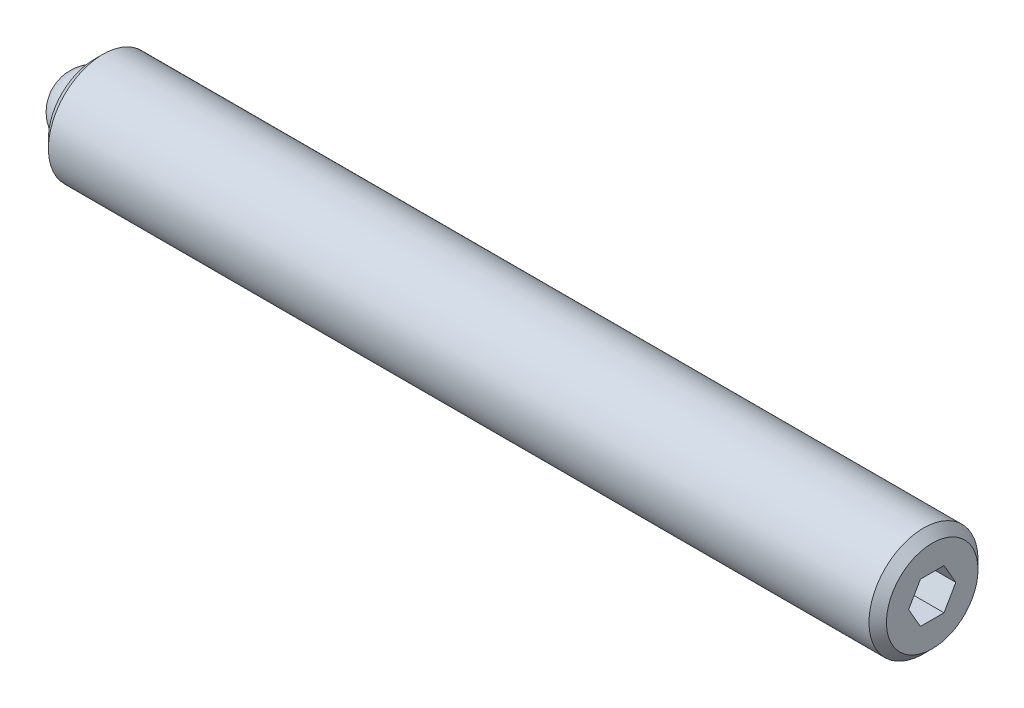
from build123d import *

# Parameters (mm, degrees)
SKETCH2_R           = 3.175
BOSS_EXTRUDE1_DEPTH = 48.815625
CHAMFER1_SIZE       = 0.508
CHAMFER2_SIZE       = 0.508
CUT_EXTRUDE2_DEPTH  = 2.286
SKETCH3_R           = 1.9812
CUT_EXTRUDE3_DEPTH  = 1.984375


with BuildPart() as part:
    # Sketch2 → Boss-Extrude1 (new body)
    with BuildSketch(Plane(origin=(0, 0, 0), x_dir=(0, 0, -1), z_dir=(1, 0, 0))):
        Circle(SKETCH2_R)
    extrude(amount=BOSS_EXTRUDE1_DEPTH)

    # Chamfer1
    chamfer1_edges = [part.edges().sort_by_distance(p)[0] for p in [
        (0, 0, 3.175),
    ]]
    chamfer(chamfer1_edges, length=CHAMFER1_SIZE)

    # Chamfer2
    chamfer2_edges = [part.edges().sort_by_distance(p)[0] for p in [
        (48.815625, 0, 3.175),
    ]]
    chamfer(chamfer2_edges, length=CHAMFER2_SIZE)

    # Sketch4 → Cut-Extrude2 (cut)
    with BuildSketch(Plane(origin=(48.815625, 0, 0), x_dir=(0, 0, -1), z_dir=(1, 0, 0))):
        Polygon((1.374815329, 0), (0.687407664, 1.190625), (-0.687407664, 1.190625), (-1.374815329, 0), (-0.687407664, -1.190625), (0.687407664, -1.190625), align=None)
    extrude(amount=-CUT_EXTRUDE2_DEPTH, mode=Mode.SUBTRACT)

    # Sketch3 → Cut-Extrude3 (cut)
    with BuildSketch(Plane.ZY):
        Circle(SKETCH3_R)
    extrude(amount=-CUT_EXTRUDE3_DEPTH, mode=Mode.SUBTRACT)


with BuildPart() as body_2:
    # Sketch5 → Revolve1 (revolve)
    with BuildSketch(Plane.ZY):
        with BuildLine():
            Line((0, 0), (0, -1.984375))
            ThreePointArc((0, -1.984375), (-1.984375, 0), (0, 1.984375))
            Line((0, 1.984375), (0, 0))
        make_face()
    revolve(axis=Axis((0, 0, 0), (0, 1, 0)))


solid = Compound([part.part, body_2.part])
